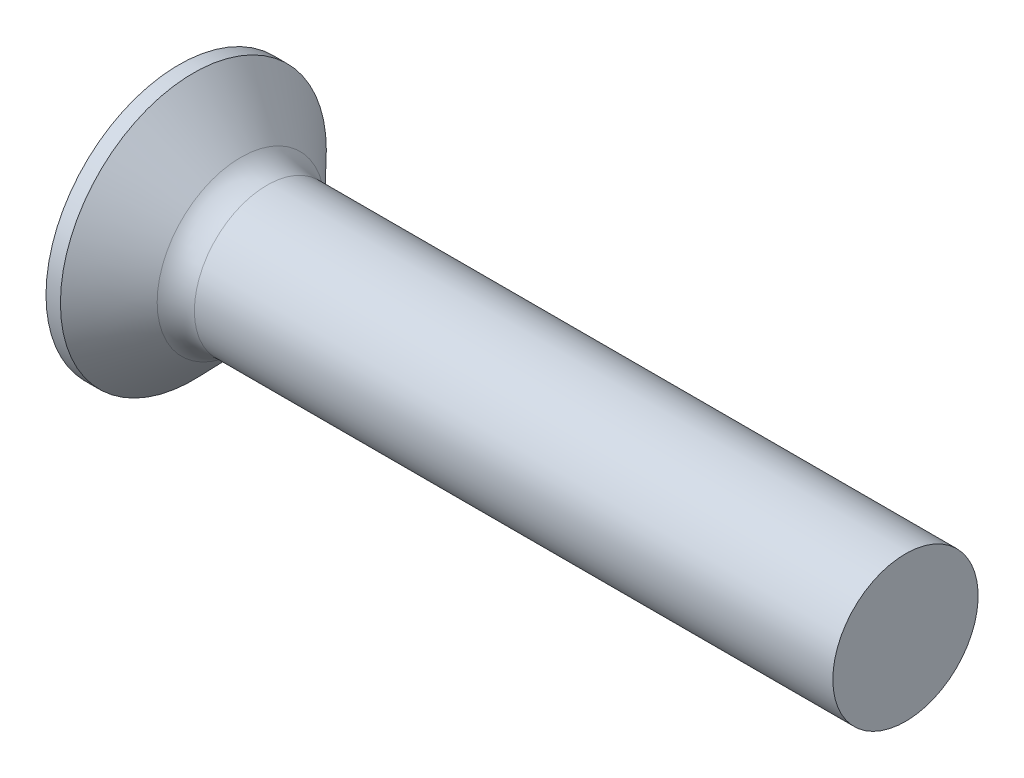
from build123d import *

# Parameters (mm, degrees)
FILLET1_R    = 2.5
RECPAT_COUNT = 2
RECPAT_ANGLE = 90


with BuildPart() as part:
    # BodySke → Base-Revolve (revolve)
    with BuildSketch(Plane.XY, mode=Mode.PRIVATE) as base_revolve_sk:
        with BuildLine():
            Line((0, 0), (52.3, 0))
            Line((52.3, 0), (52.3, 5))
            Line((52.3, 5), (7.3, 5))
            Line((7.3, 5), (3.292391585, 9.15))
            Line((3.292391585, 9.15), (2.3, 9.15))
            ThreePointArc((2.3, 9.15), (0.583806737, 4.717321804), (0, 0))
        make_face()
    revolve(base_revolve_sk.sketch.rotate(Axis((-15.875, 0, 0), (1, 0, 0)), 90), axis=Axis((-15.875, 0, 0), (1, 0, 0)))

    # Fillet1
    fillet1_edges = [part.edges().sort_by_distance(p)[0] for p in [
        (7.3, 0, -5),
    ]]
    fillet(fillet1_edges, radius=FILLET1_R)

    # Sketch3 → Recess section 0
    with BuildSketch(Plane(origin=(0, 0, 0), x_dir=(0, 0, -1), z_dir=(1, 0, 0))):
        with BuildLine():
            Line((1.08, -5.15), (-1.08, -5.15))
            Line((-1.08, -5.15), (-1.08, 5.15))
            Line((-1.08, 5.15), (1.08, 5.15))
            Line((1.08, 5.15), (1.08, -5.15))
        make_face()
    # Sketch4 → Recess section 1
    with BuildSketch(Plane(origin=(6.05, 0, 0), x_dir=(0, 0, -1), z_dir=(1, 0, 0))):
        with BuildLine():
            Line((1.08, -2.133581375), (-1.08, -2.133581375))
            Line((-1.08, -2.133581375), (-1.08, 2.133581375))
            Line((-1.08, 2.133581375), (1.08, 2.133581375))
            Line((1.08, 2.133581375), (1.08, -2.133581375))
        make_face()
    recess = loft(mode=Mode.SUBTRACT)

    # RecPat: Recess ×2 about axis
    recpat_axis = Axis((0, 0, 0), (1, 0, 0))
    for i in range(1, RECPAT_COUNT):
        add(recess.rotate(recpat_axis, i * RECPAT_ANGLE / (RECPAT_COUNT - 1)), mode=Mode.SUBTRACT)

    # RecCorSke → RecessCore (revolve, cut)
    with BuildSketch(Plane.XY, mode=Mode.PRIVATE) as recesscore_sk:
        Polygon((0, 0), (0, 2.353557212), (6.05, 1.9305), (6.677257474, 0), align=None)
    revolve(recesscore_sk.sketch.rotate(Axis((-3.175, 0, 0), (1, 0, 0)), 90), axis=Axis((-3.175, 0, 0), (1, 0, 0)), mode=Mode.SUBTRACT)


solid = part.part
